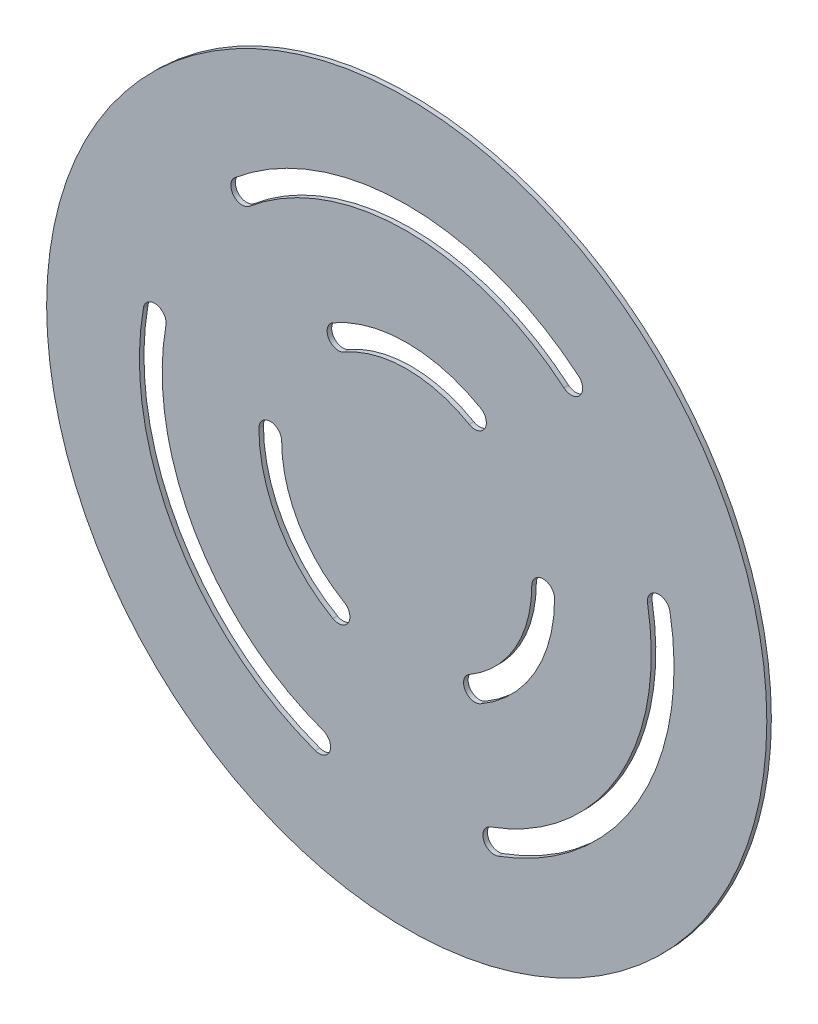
ISO-10303-21;
HEADER;
FILE_DESCRIPTION(('STEP AP214'),'2;1');
FILE_NAME('part.step','',(''),(''),'','','');
FILE_SCHEMA(('AUTOMOTIVE_DESIGN { 1 0 10303 214 1 1 1 1 }'));
ENDSEC;
DATA;
#1=APPLICATION_CONTEXT('core data for automotive mechanical design processes');
#2=APPLICATION_PROTOCOL_DEFINITION('international standard','automotive_design',2000,#1);
#3=PRODUCT_CONTEXT('',#1,'mechanical');
#4=PRODUCT('Part','Part','',(#3));
#5=PRODUCT_RELATED_PRODUCT_CATEGORY('part','',(#4));
#6=PRODUCT_DEFINITION_FORMATION('','',#4);
#7=PRODUCT_DEFINITION_CONTEXT('part definition',#1,'design');
#8=PRODUCT_DEFINITION('design','',#6,#7);
#9=PRODUCT_DEFINITION_SHAPE('','',#8);
#10=(LENGTH_UNIT() NAMED_UNIT(*) SI_UNIT(.MILLI.,.METRE.));
#11=(NAMED_UNIT(*) PLANE_ANGLE_UNIT() SI_UNIT($,.RADIAN.));
#12=(NAMED_UNIT(*) SI_UNIT($,.STERADIAN.) SOLID_ANGLE_UNIT());
#13=UNCERTAINTY_MEASURE_WITH_UNIT(LENGTH_MEASURE(1.E-05),#10,'distance_accuracy_value','');
#14=(GEOMETRIC_REPRESENTATION_CONTEXT(3) GLOBAL_UNCERTAINTY_ASSIGNED_CONTEXT((#13)) GLOBAL_UNIT_ASSIGNED_CONTEXT((#10,
#11,#12)) REPRESENTATION_CONTEXT('',''));
#15=CARTESIAN_POINT('',(0.,0.,0.));
#16=DIRECTION('',(0.,0.,1.));
#17=DIRECTION('',(1.,0.,0.));
#18=AXIS2_PLACEMENT_3D('',#15,#16,#17);
#19=CARTESIAN_POINT('',(0.,0.,2.));
#20=DIRECTION('',(0.,0.,-1.));
#21=DIRECTION('',(-1.,0.,0.));
#22=AXIS2_PLACEMENT_3D('',#19,#20,#21);
#23=CYLINDRICAL_SURFACE('',#22,158.);
#24=CARTESIAN_POINT('',(0.,0.,2.));
#25=DIRECTION('',(0.,0.,1.));
#26=DIRECTION('',(1.,0.,0.));
#27=AXIS2_PLACEMENT_3D('',#24,#25,#26);
#28=CIRCLE('',#27,158.);
#29=CARTESIAN_POINT('',(158.,0.,2.));
#30=VERTEX_POINT('',#29);
#31=EDGE_CURVE('E324',#30,#30,#28,.T.);
#32=ORIENTED_EDGE('',*,*,#31,.F.);
#33=EDGE_LOOP('',(#32));
#34=FACE_BOUND('',#33,.T.);
#35=CARTESIAN_POINT('',(0.,0.,0.));
#36=DIRECTION('',(0.,0.,1.));
#37=DIRECTION('',(1.,0.,0.));
#38=AXIS2_PLACEMENT_3D('',#35,#36,#37);
#39=CIRCLE('',#38,158.);
#40=CARTESIAN_POINT('',(158.,0.,0.));
#41=VERTEX_POINT('',#40);
#42=EDGE_CURVE('E317',#41,#41,#39,.T.);
#43=ORIENTED_EDGE('',*,*,#42,.T.);
#44=EDGE_LOOP('',(#43));
#45=FACE_BOUND('',#44,.T.);
#46=ADVANCED_FACE('F32',(#34,#45),#23,.T.);
#47=CARTESIAN_POINT('',(0.,0.,2.));
#48=DIRECTION('',(0.,0.,1.));
#49=DIRECTION('',(1.,0.,0.));
#50=AXIS2_PLACEMENT_3D('',#47,#48,#49);
#51=PLANE('',#50);
#52=CARTESIAN_POINT('',(-110.588321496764,19.4997048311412,2.));
#53=DIRECTION('',(0.,0.,1.));
#54=DIRECTION('',(-0.500000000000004,0.866025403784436,0.));
#55=AXIS2_PLACEMENT_3D('',#52,#53,#54);
#56=CIRCLE('',#55,5.00000000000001);
#57=CARTESIAN_POINT('',(-105.664282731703,18.6314639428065,2.));
#58=VERTEX_POINT('',#57);
#59=CARTESIAN_POINT('',(-115.512360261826,20.3679457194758,2.));
#60=VERTEX_POINT('',#59);
#61=EDGE_CURVE('E46',#58,#60,#56,.T.);
#62=ORIENTED_EDGE('',*,*,#61,.F.);
#63=CARTESIAN_POINT('',(2.04314785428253E-13,1.17961196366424E-13,2.));
#64=DIRECTION('',(0.,0.,-1.));
#65=DIRECTION('',(-0.500000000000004,0.866025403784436,0.));
#66=AXIS2_PLACEMENT_3D('',#63,#64,#65);
#67=CIRCLE('',#66,107.294324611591);
#68=CARTESIAN_POINT('',(-36.6968202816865,-100.82368508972,2.));
#69=VERTEX_POINT('',#68);
#70=EDGE_CURVE('E216',#69,#58,#67,.T.);
#71=ORIENTED_EDGE('',*,*,#70,.F.);
#72=CARTESIAN_POINT('',(-38.4069209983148,-105.52214819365,2.));
#73=DIRECTION('',(0.,0.,1.));
#74=DIRECTION('',(-0.500000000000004,0.866025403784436,0.));
#75=AXIS2_PLACEMENT_3D('',#72,#73,#74);
#76=CIRCLE('',#75,5.00000000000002);
#77=CARTESIAN_POINT('',(-40.1170217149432,-110.220611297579,2.));
#78=VERTEX_POINT('',#77);
#79=EDGE_CURVE('E199',#78,#69,#76,.T.);
#80=ORIENTED_EDGE('',*,*,#79,.F.);
#81=CARTESIAN_POINT('',(2.04314785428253E-13,1.17961196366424E-13,2.));
#82=DIRECTION('',(0.,0.,1.));
#83=DIRECTION('',(-0.500000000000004,0.866025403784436,0.));
#84=AXIS2_PLACEMENT_3D('',#81,#82,#83);
#85=CIRCLE('',#84,117.294324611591);
#86=EDGE_CURVE('E209',#60,#78,#85,.T.);
#87=ORIENTED_EDGE('',*,*,#86,.F.);
#88=EDGE_LOOP('',(#62,#71,#80,#87));
#89=FACE_BOUND('',#88,.T.);
#90=CARTESIAN_POINT('',(38.4069209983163,-105.522148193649,2.));
#91=DIRECTION('',(0.,0.,1.));
#92=DIRECTION('',(-0.499999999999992,-0.866025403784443,0.));
#93=AXIS2_PLACEMENT_3D('',#90,#91,#92);
#94=CIRCLE('',#93,5.00000000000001);
#95=CARTESIAN_POINT('',(36.696820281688,-100.82368508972,2.));
#96=VERTEX_POINT('',#95);
#97=CARTESIAN_POINT('',(40.1170217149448,-110.220611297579,2.));
#98=VERTEX_POINT('',#97);
#99=EDGE_CURVE('E54',#96,#98,#94,.T.);
#100=ORIENTED_EDGE('',*,*,#99,.F.);
#101=CARTESIAN_POINT('',(-2.04314785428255E-13,1.17961196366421E-13,2.));
#102=DIRECTION('',(0.,0.,-1.));
#103=DIRECTION('',(-0.499999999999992,-0.866025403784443,0.));
#104=AXIS2_PLACEMENT_3D('',#101,#102,#103);
#105=CIRCLE('',#104,107.294324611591);
#106=CARTESIAN_POINT('',(105.664282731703,18.631463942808,2.));
#107=VERTEX_POINT('',#106);
#108=EDGE_CURVE('E233',#107,#96,#105,.T.);
#109=ORIENTED_EDGE('',*,*,#108,.F.);
#110=CARTESIAN_POINT('',(110.588321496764,19.4997048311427,2.));
#111=DIRECTION('',(0.,0.,1.));
#112=DIRECTION('',(-0.499999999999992,-0.866025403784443,0.));
#113=AXIS2_PLACEMENT_3D('',#110,#111,#112);
#114=CIRCLE('',#113,5.00000000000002);
#115=CARTESIAN_POINT('',(115.512360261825,20.3679457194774,2.));
#116=VERTEX_POINT('',#115);
#117=EDGE_CURVE('E230',#116,#107,#114,.T.);
#118=ORIENTED_EDGE('',*,*,#117,.F.);
#119=CARTESIAN_POINT('',(-2.04314785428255E-13,1.17961196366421E-13,2.));
#120=DIRECTION('',(0.,0.,1.));
#121=DIRECTION('',(-0.499999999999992,-0.866025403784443,0.));
#122=AXIS2_PLACEMENT_3D('',#119,#120,#121);
#123=CIRCLE('',#122,117.294324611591);
#124=EDGE_CURVE('E227',#98,#116,#123,.T.);
#125=ORIENTED_EDGE('',*,*,#124,.F.);
#126=EDGE_LOOP('',(#100,#109,#118,#125));
#127=FACE_BOUND('',#126,.T.);
#128=CARTESIAN_POINT('',(29.9356442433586,-51.8500567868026,2.));
#129=DIRECTION('',(0.,0.,1.));
#130=DIRECTION('',(-0.499999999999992,-0.866025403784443,0.));
#131=AXIS2_PLACEMENT_3D('',#128,#129,#130);
#132=CIRCLE('',#131,5.);
#133=CARTESIAN_POINT('',(27.4356442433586,-47.5199297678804,2.));
#134=VERTEX_POINT('',#133);
#135=CARTESIAN_POINT('',(32.4356442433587,-56.1801838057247,2.));
#136=VERTEX_POINT('',#135);
#137=EDGE_CURVE('E239',#134,#136,#132,.T.);
#138=ORIENTED_EDGE('',*,*,#137,.F.);
#139=CARTESIAN_POINT('',(0.,0.,2.));
#140=DIRECTION('',(0.,0.,-1.));
#141=DIRECTION('',(-0.499999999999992,-0.866025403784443,0.));
#142=AXIS2_PLACEMENT_3D('',#139,#140,#141);
#143=CIRCLE('',#142,54.8712884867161);
#144=CARTESIAN_POINT('',(54.8712884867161,5.13478148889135E-13,2.));
#145=VERTEX_POINT('',#144);
#146=EDGE_CURVE('E252',#145,#134,#143,.T.);
#147=ORIENTED_EDGE('',*,*,#146,.F.);
#148=CARTESIAN_POINT('',(59.8712884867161,5.55111512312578E-13,2.));
#149=DIRECTION('',(0.,0.,1.));
#150=DIRECTION('',(-0.499999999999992,-0.866025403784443,0.));
#151=AXIS2_PLACEMENT_3D('',#148,#149,#150);
#152=CIRCLE('',#151,4.99999999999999);
#153=CARTESIAN_POINT('',(64.8712884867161,6.07153216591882E-13,2.));
#154=VERTEX_POINT('',#153);
#155=EDGE_CURVE('E249',#154,#145,#152,.T.);
#156=ORIENTED_EDGE('',*,*,#155,.F.);
#157=CARTESIAN_POINT('',(0.,0.,2.));
#158=DIRECTION('',(0.,0.,1.));
#159=DIRECTION('',(-0.499999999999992,-0.866025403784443,0.));
#160=AXIS2_PLACEMENT_3D('',#157,#158,#159);
#161=CIRCLE('',#160,64.8712884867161);
#162=EDGE_CURVE('E246',#136,#154,#161,.T.);
#163=ORIENTED_EDGE('',*,*,#162,.F.);
#164=EDGE_LOOP('',(#138,#147,#156,#163));
#165=FACE_BOUND('',#164,.T.);
#166=CARTESIAN_POINT('',(-59.8712884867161,-3.88578058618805E-13,2.));
#167=DIRECTION('',(0.,0.,1.));
#168=DIRECTION('',(-0.500000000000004,0.866025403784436,0.));
#169=AXIS2_PLACEMENT_3D('',#166,#167,#168);
#170=CIRCLE('',#169,5.);
#171=CARTESIAN_POINT('',(-54.8712884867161,-3.57353036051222E-13,2.));
#172=VERTEX_POINT('',#171);
#173=CARTESIAN_POINT('',(-64.8712884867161,-4.26741975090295E-13,2.));
#174=VERTEX_POINT('',#173);
#175=EDGE_CURVE('E223',#172,#174,#170,.T.);
#176=ORIENTED_EDGE('',*,*,#175,.F.);
#177=CARTESIAN_POINT('',(0.,0.,2.));
#178=DIRECTION('',(0.,0.,-1.));
#179=DIRECTION('',(-0.500000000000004,0.866025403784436,0.));
#180=AXIS2_PLACEMENT_3D('',#177,#178,#179);
#181=CIRCLE('',#180,54.8712884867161);
#182=CARTESIAN_POINT('',(-27.4356442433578,-47.5199297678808,2.));
#183=VERTEX_POINT('',#182);
#184=EDGE_CURVE('E271',#183,#172,#181,.T.);
#185=ORIENTED_EDGE('',*,*,#184,.F.);
#186=CARTESIAN_POINT('',(-29.9356442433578,-51.850056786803,2.));
#187=DIRECTION('',(0.,0.,1.));
#188=DIRECTION('',(-0.500000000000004,0.866025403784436,0.));
#189=AXIS2_PLACEMENT_3D('',#186,#187,#188);
#190=CIRCLE('',#189,4.99999999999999);
#191=CARTESIAN_POINT('',(-32.4356442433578,-56.1801838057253,2.));
#192=VERTEX_POINT('',#191);
#193=EDGE_CURVE('E268',#192,#183,#190,.T.);
#194=ORIENTED_EDGE('',*,*,#193,.F.);
#195=CARTESIAN_POINT('',(0.,0.,2.));
#196=DIRECTION('',(0.,0.,1.));
#197=DIRECTION('',(-0.500000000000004,0.866025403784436,0.));
#198=AXIS2_PLACEMENT_3D('',#195,#196,#197);
#199=CIRCLE('',#198,64.8712884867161);
#200=EDGE_CURVE('E265',#174,#192,#199,.T.);
#201=ORIENTED_EDGE('',*,*,#200,.F.);
#202=EDGE_LOOP('',(#176,#185,#194,#201));
#203=FACE_BOUND('',#202,.T.);
#204=CARTESIAN_POINT('',(72.181400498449,86.0224433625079,2.));
#205=DIRECTION('',(0.,0.,1.));
#206=DIRECTION('',(1.,0.,0.));
#207=AXIS2_PLACEMENT_3D('',#204,#205,#206);
#208=CIRCLE('',#207,5.00000000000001);
#209=CARTESIAN_POINT('',(68.9674624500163,82.192221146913,2.));
#210=VERTEX_POINT('',#209);
#211=CARTESIAN_POINT('',(75.3953385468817,89.8526655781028,2.));
#212=VERTEX_POINT('',#211);
#213=EDGE_CURVE('E277',#210,#212,#208,.T.);
#214=ORIENTED_EDGE('',*,*,#213,.F.);
#215=CARTESIAN_POINT('',(0.,-2.35922392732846E-13,2.));
#216=DIRECTION('',(0.,0.,-1.));
#217=DIRECTION('',(1.,0.,0.));
#218=AXIS2_PLACEMENT_3D('',#215,#216,#217);
#219=CIRCLE('',#218,107.294324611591);
#220=CARTESIAN_POINT('',(-68.9674624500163,82.1922211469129,2.));
#221=VERTEX_POINT('',#220);
#222=EDGE_CURVE('E291',#221,#210,#219,.T.);
#223=ORIENTED_EDGE('',*,*,#222,.F.);
#224=CARTESIAN_POINT('',(-72.1814004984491,86.0224433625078,2.));
#225=DIRECTION('',(0.,0.,1.));
#226=DIRECTION('',(1.,0.,0.));
#227=AXIS2_PLACEMENT_3D('',#224,#225,#226);
#228=CIRCLE('',#227,5.00000000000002);
#229=CARTESIAN_POINT('',(-75.3953385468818,89.8526655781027,2.));
#230=VERTEX_POINT('',#229);
#231=EDGE_CURVE('E288',#230,#221,#228,.T.);
#232=ORIENTED_EDGE('',*,*,#231,.F.);
#233=CARTESIAN_POINT('',(0.,-2.35922392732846E-13,2.));
#234=DIRECTION('',(0.,0.,1.));
#235=DIRECTION('',(1.,0.,0.));
#236=AXIS2_PLACEMENT_3D('',#233,#234,#235);
#237=CIRCLE('',#236,117.294324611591);
#238=EDGE_CURVE('E285',#212,#230,#237,.T.);
#239=ORIENTED_EDGE('',*,*,#238,.F.);
#240=EDGE_LOOP('',(#214,#223,#232,#239));
#241=FACE_BOUND('',#240,.T.);
#242=CARTESIAN_POINT('',(29.9356442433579,51.8500567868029,2.));
#243=DIRECTION('',(0.,0.,1.));
#244=DIRECTION('',(1.,0.,0.));
#245=AXIS2_PLACEMENT_3D('',#242,#243,#244);
#246=CIRCLE('',#245,5.);
#247=CARTESIAN_POINT('',(27.4356442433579,47.5199297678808,2.));
#248=VERTEX_POINT('',#247);
#249=CARTESIAN_POINT('',(32.4356442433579,56.1801838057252,2.));
#250=VERTEX_POINT('',#249);
#251=EDGE_CURVE('E297',#248,#250,#246,.T.);
#252=ORIENTED_EDGE('',*,*,#251,.F.);
#253=CARTESIAN_POINT('',(0.,0.,2.));
#254=DIRECTION('',(0.,0.,-1.));
#255=DIRECTION('',(1.,0.,0.));
#256=AXIS2_PLACEMENT_3D('',#253,#254,#255);
#257=CIRCLE('',#256,54.8712884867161);
#258=CARTESIAN_POINT('',(-27.435644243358,47.5199297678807,2.));
#259=VERTEX_POINT('',#258);
#260=EDGE_CURVE('E311',#259,#248,#257,.T.);
#261=ORIENTED_EDGE('',*,*,#260,.F.);
#262=CARTESIAN_POINT('',(-29.935644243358,51.8500567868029,2.));
#263=DIRECTION('',(0.,0.,1.));
#264=DIRECTION('',(1.,0.,0.));
#265=AXIS2_PLACEMENT_3D('',#262,#263,#264);
#266=CIRCLE('',#265,4.99999999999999);
#267=CARTESIAN_POINT('',(-32.435644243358,56.1801838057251,2.));
#268=VERTEX_POINT('',#267);
#269=EDGE_CURVE('E308',#268,#259,#266,.T.);
#270=ORIENTED_EDGE('',*,*,#269,.F.);
#271=CARTESIAN_POINT('',(0.,0.,2.));
#272=DIRECTION('',(0.,0.,1.));
#273=DIRECTION('',(1.,0.,0.));
#274=AXIS2_PLACEMENT_3D('',#271,#272,#273);
#275=CIRCLE('',#274,64.8712884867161);
#276=EDGE_CURVE('E305',#250,#268,#275,.T.);
#277=ORIENTED_EDGE('',*,*,#276,.F.);
#278=EDGE_LOOP('',(#252,#261,#270,#277));
#279=FACE_BOUND('',#278,.T.);
#280=ORIENTED_EDGE('',*,*,#31,.T.);
#281=EDGE_LOOP('',(#280));
#282=FACE_BOUND('',#281,.T.);
#283=ADVANCED_FACE('F213',(#89,#127,#165,#203,#241,#279,#282),#51,.T.);
#284=CARTESIAN_POINT('',(0.,0.,0.));
#285=DIRECTION('',(0.,0.,1.));
#286=DIRECTION('',(1.,0.,0.));
#287=AXIS2_PLACEMENT_3D('',#284,#285,#286);
#288=PLANE('',#287);
#289=CARTESIAN_POINT('',(2.04314785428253E-13,1.17961196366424E-13,0.));
#290=DIRECTION('',(0.,0.,1.));
#291=DIRECTION('',(1.,0.,0.));
#292=AXIS2_PLACEMENT_3D('',#289,#290,#291);
#293=CIRCLE('',#292,107.294324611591);
#294=CARTESIAN_POINT('',(-36.6968202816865,-100.82368508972,0.));
#295=VERTEX_POINT('',#294);
#296=CARTESIAN_POINT('',(-105.664282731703,18.6314639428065,0.));
#297=VERTEX_POINT('',#296);
#298=EDGE_CURVE('E39',#295,#297,#293,.F.);
#299=ORIENTED_EDGE('',*,*,#298,.T.);
#300=CARTESIAN_POINT('',(-110.588321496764,19.4997048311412,0.));
#301=DIRECTION('',(0.,0.,1.));
#302=DIRECTION('',(1.,0.,0.));
#303=AXIS2_PLACEMENT_3D('',#300,#301,#302);
#304=CIRCLE('',#303,5.00000000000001);
#305=CARTESIAN_POINT('',(-115.512360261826,20.3679457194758,0.));
#306=VERTEX_POINT('',#305);
#307=EDGE_CURVE('E11',#297,#306,#304,.T.);
#308=ORIENTED_EDGE('',*,*,#307,.T.);
#309=CARTESIAN_POINT('',(2.04314785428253E-13,1.17961196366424E-13,0.));
#310=DIRECTION('',(0.,0.,1.));
#311=DIRECTION('',(1.,0.,0.));
#312=AXIS2_PLACEMENT_3D('',#309,#310,#311);
#313=CIRCLE('',#312,117.294324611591);
#314=CARTESIAN_POINT('',(-40.1170217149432,-110.220611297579,0.));
#315=VERTEX_POINT('',#314);
#316=EDGE_CURVE('E389',#306,#315,#313,.T.);
#317=ORIENTED_EDGE('',*,*,#316,.T.);
#318=CARTESIAN_POINT('',(-38.4069209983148,-105.52214819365,0.));
#319=DIRECTION('',(0.,0.,1.));
#320=DIRECTION('',(1.,0.,0.));
#321=AXIS2_PLACEMENT_3D('',#318,#319,#320);
#322=CIRCLE('',#321,5.00000000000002);
#323=EDGE_CURVE('E202',#315,#295,#322,.T.);
#324=ORIENTED_EDGE('',*,*,#323,.T.);
#325=EDGE_LOOP('',(#299,#308,#317,#324));
#326=FACE_BOUND('',#325,.T.);
#327=CARTESIAN_POINT('',(-2.04314785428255E-13,1.17961196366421E-13,0.));
#328=DIRECTION('',(0.,0.,1.));
#329=DIRECTION('',(1.,0.,0.));
#330=AXIS2_PLACEMENT_3D('',#327,#328,#329);
#331=CIRCLE('',#330,107.294324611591);
#332=CARTESIAN_POINT('',(105.664282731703,18.631463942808,0.));
#333=VERTEX_POINT('',#332);
#334=CARTESIAN_POINT('',(36.696820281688,-100.82368508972,0.));
#335=VERTEX_POINT('',#334);
#336=EDGE_CURVE('E383',#333,#335,#331,.F.);
#337=ORIENTED_EDGE('',*,*,#336,.T.);
#338=CARTESIAN_POINT('',(38.4069209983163,-105.522148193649,0.));
#339=DIRECTION('',(0.,0.,1.));
#340=DIRECTION('',(1.,0.,0.));
#341=AXIS2_PLACEMENT_3D('',#338,#339,#340);
#342=CIRCLE('',#341,5.00000000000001);
#343=CARTESIAN_POINT('',(40.1170217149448,-110.220611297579,0.));
#344=VERTEX_POINT('',#343);
#345=EDGE_CURVE('E386',#335,#344,#342,.T.);
#346=ORIENTED_EDGE('',*,*,#345,.T.);
#347=CARTESIAN_POINT('',(-2.04314785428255E-13,1.17961196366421E-13,0.));
#348=DIRECTION('',(0.,0.,1.));
#349=DIRECTION('',(1.,0.,0.));
#350=AXIS2_PLACEMENT_3D('',#347,#348,#349);
#351=CIRCLE('',#350,117.294324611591);
#352=CARTESIAN_POINT('',(115.512360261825,20.3679457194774,0.));
#353=VERTEX_POINT('',#352);
#354=EDGE_CURVE('E377',#344,#353,#351,.T.);
#355=ORIENTED_EDGE('',*,*,#354,.T.);
#356=CARTESIAN_POINT('',(110.588321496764,19.4997048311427,0.));
#357=DIRECTION('',(0.,0.,1.));
#358=DIRECTION('',(1.,0.,0.));
#359=AXIS2_PLACEMENT_3D('',#356,#357,#358);
#360=CIRCLE('',#359,5.00000000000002);
#361=EDGE_CURVE('E380',#353,#333,#360,.T.);
#362=ORIENTED_EDGE('',*,*,#361,.T.);
#363=EDGE_LOOP('',(#337,#346,#355,#362));
#364=FACE_BOUND('',#363,.T.);
#365=CARTESIAN_POINT('',(0.,0.,0.));
#366=DIRECTION('',(0.,0.,1.));
#367=DIRECTION('',(1.,0.,0.));
#368=AXIS2_PLACEMENT_3D('',#365,#366,#367);
#369=CIRCLE('',#368,54.8712884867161);
#370=CARTESIAN_POINT('',(54.8712884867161,5.13478148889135E-13,0.));
#371=VERTEX_POINT('',#370);
#372=CARTESIAN_POINT('',(27.4356442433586,-47.5199297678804,0.));
#373=VERTEX_POINT('',#372);
#374=EDGE_CURVE('E371',#371,#373,#369,.F.);
#375=ORIENTED_EDGE('',*,*,#374,.T.);
#376=CARTESIAN_POINT('',(29.9356442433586,-51.8500567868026,0.));
#377=DIRECTION('',(0.,0.,1.));
#378=DIRECTION('',(1.,0.,0.));
#379=AXIS2_PLACEMENT_3D('',#376,#377,#378);
#380=CIRCLE('',#379,5.);
#381=CARTESIAN_POINT('',(32.4356442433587,-56.1801838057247,0.));
#382=VERTEX_POINT('',#381);
#383=EDGE_CURVE('E374',#373,#382,#380,.T.);
#384=ORIENTED_EDGE('',*,*,#383,.T.);
#385=CARTESIAN_POINT('',(0.,0.,0.));
#386=DIRECTION('',(0.,0.,1.));
#387=DIRECTION('',(1.,0.,0.));
#388=AXIS2_PLACEMENT_3D('',#385,#386,#387);
#389=CIRCLE('',#388,64.8712884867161);
#390=CARTESIAN_POINT('',(64.8712884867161,0.,0.));
#391=VERTEX_POINT('',#390);
#392=EDGE_CURVE('E365',#382,#391,#389,.T.);
#393=ORIENTED_EDGE('',*,*,#392,.T.);
#394=CARTESIAN_POINT('',(59.8712884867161,5.55111512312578E-13,0.));
#395=DIRECTION('',(0.,0.,1.));
#396=DIRECTION('',(1.,0.,0.));
#397=AXIS2_PLACEMENT_3D('',#394,#395,#396);
#398=CIRCLE('',#397,4.99999999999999);
#399=EDGE_CURVE('E368',#391,#371,#398,.T.);
#400=ORIENTED_EDGE('',*,*,#399,.T.);
#401=EDGE_LOOP('',(#375,#384,#393,#400));
#402=FACE_BOUND('',#401,.T.);
#403=CARTESIAN_POINT('',(0.,0.,0.));
#404=DIRECTION('',(0.,0.,1.));
#405=DIRECTION('',(1.,0.,0.));
#406=AXIS2_PLACEMENT_3D('',#403,#404,#405);
#407=CIRCLE('',#406,54.8712884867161);
#408=CARTESIAN_POINT('',(-27.4356442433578,-47.5199297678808,0.));
#409=VERTEX_POINT('',#408);
#410=CARTESIAN_POINT('',(-54.8712884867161,-3.57353036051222E-13,0.));
#411=VERTEX_POINT('',#410);
#412=EDGE_CURVE('E359',#409,#411,#407,.F.);
#413=ORIENTED_EDGE('',*,*,#412,.T.);
#414=CARTESIAN_POINT('',(-59.8712884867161,-3.88578058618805E-13,0.));
#415=DIRECTION('',(0.,0.,1.));
#416=DIRECTION('',(1.,0.,0.));
#417=AXIS2_PLACEMENT_3D('',#414,#415,#416);
#418=CIRCLE('',#417,5.);
#419=CARTESIAN_POINT('',(-64.8712884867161,-4.26741975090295E-13,0.));
#420=VERTEX_POINT('',#419);
#421=EDGE_CURVE('E362',#411,#420,#418,.T.);
#422=ORIENTED_EDGE('',*,*,#421,.T.);
#423=CARTESIAN_POINT('',(0.,0.,0.));
#424=DIRECTION('',(0.,0.,1.));
#425=DIRECTION('',(1.,0.,0.));
#426=AXIS2_PLACEMENT_3D('',#423,#424,#425);
#427=CIRCLE('',#426,64.8712884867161);
#428=CARTESIAN_POINT('',(-32.4356442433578,-56.1801838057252,0.));
#429=VERTEX_POINT('',#428);
#430=EDGE_CURVE('E353',#420,#429,#427,.T.);
#431=ORIENTED_EDGE('',*,*,#430,.T.);
#432=CARTESIAN_POINT('',(-29.9356442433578,-51.850056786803,0.));
#433=DIRECTION('',(0.,0.,1.));
#434=DIRECTION('',(1.,0.,0.));
#435=AXIS2_PLACEMENT_3D('',#432,#433,#434);
#436=CIRCLE('',#435,4.99999999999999);
#437=EDGE_CURVE('E356',#429,#409,#436,.T.);
#438=ORIENTED_EDGE('',*,*,#437,.T.);
#439=EDGE_LOOP('',(#413,#422,#431,#438));
#440=FACE_BOUND('',#439,.T.);
#441=CARTESIAN_POINT('',(0.,-2.35922392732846E-13,0.));
#442=DIRECTION('',(0.,0.,1.));
#443=DIRECTION('',(1.,0.,0.));
#444=AXIS2_PLACEMENT_3D('',#441,#442,#443);
#445=CIRCLE('',#444,107.294324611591);
#446=CARTESIAN_POINT('',(-68.9674624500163,82.1922211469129,0.));
#447=VERTEX_POINT('',#446);
#448=CARTESIAN_POINT('',(68.9674624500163,82.192221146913,0.));
#449=VERTEX_POINT('',#448);
#450=EDGE_CURVE('E347',#447,#449,#445,.F.);
#451=ORIENTED_EDGE('',*,*,#450,.T.);
#452=CARTESIAN_POINT('',(72.181400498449,86.0224433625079,0.));
#453=DIRECTION('',(0.,0.,1.));
#454=DIRECTION('',(1.,0.,0.));
#455=AXIS2_PLACEMENT_3D('',#452,#453,#454);
#456=CIRCLE('',#455,5.00000000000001);
#457=CARTESIAN_POINT('',(75.3953385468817,89.8526655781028,0.));
#458=VERTEX_POINT('',#457);
#459=EDGE_CURVE('E350',#449,#458,#456,.T.);
#460=ORIENTED_EDGE('',*,*,#459,.T.);
#461=CARTESIAN_POINT('',(0.,-2.35922392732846E-13,0.));
#462=DIRECTION('',(0.,0.,1.));
#463=DIRECTION('',(1.,0.,0.));
#464=AXIS2_PLACEMENT_3D('',#461,#462,#463);
#465=CIRCLE('',#464,117.294324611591);
#466=CARTESIAN_POINT('',(-75.3953385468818,89.8526655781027,0.));
#467=VERTEX_POINT('',#466);
#468=EDGE_CURVE('E341',#458,#467,#465,.T.);
#469=ORIENTED_EDGE('',*,*,#468,.T.);
#470=CARTESIAN_POINT('',(-72.1814004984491,86.0224433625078,0.));
#471=DIRECTION('',(0.,0.,1.));
#472=DIRECTION('',(1.,0.,0.));
#473=AXIS2_PLACEMENT_3D('',#470,#471,#472);
#474=CIRCLE('',#473,5.00000000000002);
#475=EDGE_CURVE('E344',#467,#447,#474,.T.);
#476=ORIENTED_EDGE('',*,*,#475,.T.);
#477=EDGE_LOOP('',(#451,#460,#469,#476));
#478=FACE_BOUND('',#477,.T.);
#479=CARTESIAN_POINT('',(0.,0.,0.));
#480=DIRECTION('',(0.,0.,1.));
#481=DIRECTION('',(1.,0.,0.));
#482=AXIS2_PLACEMENT_3D('',#479,#480,#481);
#483=CIRCLE('',#482,54.8712884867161);
#484=CARTESIAN_POINT('',(-27.435644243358,47.5199297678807,0.));
#485=VERTEX_POINT('',#484);
#486=CARTESIAN_POINT('',(27.4356442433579,47.5199297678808,0.));
#487=VERTEX_POINT('',#486);
#488=EDGE_CURVE('E335',#485,#487,#483,.F.);
#489=ORIENTED_EDGE('',*,*,#488,.T.);
#490=CARTESIAN_POINT('',(29.9356442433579,51.8500567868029,0.));
#491=DIRECTION('',(0.,0.,1.));
#492=DIRECTION('',(1.,0.,0.));
#493=AXIS2_PLACEMENT_3D('',#490,#491,#492);
#494=CIRCLE('',#493,5.);
#495=CARTESIAN_POINT('',(32.4356442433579,56.1801838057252,0.));
#496=VERTEX_POINT('',#495);
#497=EDGE_CURVE('E338',#487,#496,#494,.T.);
#498=ORIENTED_EDGE('',*,*,#497,.T.);
#499=CARTESIAN_POINT('',(0.,0.,0.));
#500=DIRECTION('',(0.,0.,1.));
#501=DIRECTION('',(1.,0.,0.));
#502=AXIS2_PLACEMENT_3D('',#499,#500,#501);
#503=CIRCLE('',#502,64.8712884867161);
#504=CARTESIAN_POINT('',(-32.435644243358,56.1801838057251,0.));
#505=VERTEX_POINT('',#504);
#506=EDGE_CURVE('E327',#496,#505,#503,.T.);
#507=ORIENTED_EDGE('',*,*,#506,.T.);
#508=CARTESIAN_POINT('',(-29.935644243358,51.8500567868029,0.));
#509=DIRECTION('',(0.,0.,1.));
#510=DIRECTION('',(1.,0.,0.));
#511=AXIS2_PLACEMENT_3D('',#508,#509,#510);
#512=CIRCLE('',#511,4.99999999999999);
#513=EDGE_CURVE('E332',#505,#485,#512,.T.);
#514=ORIENTED_EDGE('',*,*,#513,.T.);
#515=EDGE_LOOP('',(#489,#498,#507,#514));
#516=FACE_BOUND('',#515,.T.);
#517=ORIENTED_EDGE('',*,*,#42,.F.);
#518=EDGE_LOOP('',(#517));
#519=FACE_BOUND('',#518,.T.);
#520=ADVANCED_FACE('F393',(#326,#364,#402,#440,#478,#516,#519),#288,.F.);
#521=CARTESIAN_POINT('',(29.9356442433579,51.8500567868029,-8.));
#522=DIRECTION('',(0.,0.,1.));
#523=DIRECTION('',(1.,0.,0.));
#524=AXIS2_PLACEMENT_3D('',#521,#522,#523);
#525=CYLINDRICAL_SURFACE('',#524,5.);
#526=DIRECTION('',(0.,0.,1.));
#527=VECTOR('',#526,1.);
#528=CARTESIAN_POINT('',(27.4356442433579,47.5199297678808,-8.));
#529=LINE('',#528,#527);
#530=EDGE_CURVE('E315',#487,#248,#529,.T.);
#531=ORIENTED_EDGE('',*,*,#530,.T.);
#532=ORIENTED_EDGE('',*,*,#251,.T.);
#533=DIRECTION('',(0.,0.,1.));
#534=VECTOR('',#533,1.);
#535=CARTESIAN_POINT('',(32.4356442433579,56.1801838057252,-8.));
#536=LINE('',#535,#534);
#537=EDGE_CURVE('E314',#496,#250,#536,.T.);
#538=ORIENTED_EDGE('',*,*,#537,.F.);
#539=ORIENTED_EDGE('',*,*,#497,.F.);
#540=EDGE_LOOP('',(#531,#532,#538,#539));
#541=FACE_BOUND('',#540,.T.);
#542=ADVANCED_FACE('F423',(#541),#525,.F.);
#543=CARTESIAN_POINT('',(0.,0.,-8.));
#544=DIRECTION('',(0.,0.,1.));
#545=DIRECTION('',(1.,0.,0.));
#546=AXIS2_PLACEMENT_3D('',#543,#544,#545);
#547=CYLINDRICAL_SURFACE('',#546,54.8712884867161);
#548=DIRECTION('',(0.,0.,1.));
#549=VECTOR('',#548,1.);
#550=CARTESIAN_POINT('',(-27.435644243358,47.5199297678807,-8.));
#551=LINE('',#550,#549);
#552=EDGE_CURVE('E318',#485,#259,#551,.T.);
#553=ORIENTED_EDGE('',*,*,#552,.T.);
#554=ORIENTED_EDGE('',*,*,#260,.T.);
#555=ORIENTED_EDGE('',*,*,#530,.F.);
#556=ORIENTED_EDGE('',*,*,#488,.F.);
#557=EDGE_LOOP('',(#553,#554,#555,#556));
#558=FACE_BOUND('',#557,.T.);
#559=ADVANCED_FACE('F427',(#558),#547,.T.);
#560=CARTESIAN_POINT('',(-29.935644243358,51.8500567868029,-8.));
#561=DIRECTION('',(0.,0.,1.));
#562=DIRECTION('',(1.,0.,0.));
#563=AXIS2_PLACEMENT_3D('',#560,#561,#562);
#564=CYLINDRICAL_SURFACE('',#563,4.99999999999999);
#565=DIRECTION('',(0.,0.,1.));
#566=VECTOR('',#565,1.);
#567=CARTESIAN_POINT('',(-32.435644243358,56.1801838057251,-8.));
#568=LINE('',#567,#566);
#569=EDGE_CURVE('E320',#505,#268,#568,.T.);
#570=ORIENTED_EDGE('',*,*,#569,.T.);
#571=ORIENTED_EDGE('',*,*,#269,.T.);
#572=ORIENTED_EDGE('',*,*,#552,.F.);
#573=ORIENTED_EDGE('',*,*,#513,.F.);
#574=EDGE_LOOP('',(#570,#571,#572,#573));
#575=FACE_BOUND('',#574,.T.);
#576=ADVANCED_FACE('F435',(#575),#564,.F.);
#577=CARTESIAN_POINT('',(0.,0.,-8.));
#578=DIRECTION('',(0.,0.,1.));
#579=DIRECTION('',(1.,0.,0.));
#580=AXIS2_PLACEMENT_3D('',#577,#578,#579);
#581=CYLINDRICAL_SURFACE('',#580,64.8712884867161);
#582=ORIENTED_EDGE('',*,*,#537,.T.);
#583=ORIENTED_EDGE('',*,*,#276,.T.);
#584=ORIENTED_EDGE('',*,*,#569,.F.);
#585=ORIENTED_EDGE('',*,*,#506,.F.);
#586=EDGE_LOOP('',(#582,#583,#584,#585));
#587=FACE_BOUND('',#586,.T.);
#588=ADVANCED_FACE('F431',(#587),#581,.F.);
#589=CARTESIAN_POINT('',(72.181400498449,86.0224433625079,-8.));
#590=DIRECTION('',(0.,0.,1.));
#591=DIRECTION('',(1.,0.,0.));
#592=AXIS2_PLACEMENT_3D('',#589,#590,#591);
#593=CYLINDRICAL_SURFACE('',#592,5.00000000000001);
#594=DIRECTION('',(0.,0.,1.));
#595=VECTOR('',#594,1.);
#596=CARTESIAN_POINT('',(68.9674624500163,82.192221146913,-8.));
#597=LINE('',#596,#595);
#598=EDGE_CURVE('E295',#449,#210,#597,.T.);
#599=ORIENTED_EDGE('',*,*,#598,.T.);
#600=ORIENTED_EDGE('',*,*,#213,.T.);
#601=DIRECTION('',(0.,0.,1.));
#602=VECTOR('',#601,1.);
#603=CARTESIAN_POINT('',(75.3953385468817,89.8526655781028,-8.));
#604=LINE('',#603,#602);
#605=EDGE_CURVE('E294',#458,#212,#604,.T.);
#606=ORIENTED_EDGE('',*,*,#605,.F.);
#607=ORIENTED_EDGE('',*,*,#459,.F.);
#608=EDGE_LOOP('',(#599,#600,#606,#607));
#609=FACE_BOUND('',#608,.T.);
#610=ADVANCED_FACE('F434',(#609),#593,.F.);
#611=CARTESIAN_POINT('',(0.,-2.35922392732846E-13,-8.));
#612=DIRECTION('',(0.,0.,1.));
#613=DIRECTION('',(1.,0.,0.));
#614=AXIS2_PLACEMENT_3D('',#611,#612,#613);
#615=CYLINDRICAL_SURFACE('',#614,107.294324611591);
#616=DIRECTION('',(0.,0.,1.));
#617=VECTOR('',#616,1.);
#618=CARTESIAN_POINT('',(-68.9674624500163,82.1922211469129,-8.));
#619=LINE('',#618,#617);
#620=EDGE_CURVE('E298',#447,#221,#619,.T.);
#621=ORIENTED_EDGE('',*,*,#620,.T.);
#622=ORIENTED_EDGE('',*,*,#222,.T.);
#623=ORIENTED_EDGE('',*,*,#598,.F.);
#624=ORIENTED_EDGE('',*,*,#450,.F.);
#625=EDGE_LOOP('',(#621,#622,#623,#624));
#626=FACE_BOUND('',#625,.T.);
#627=ADVANCED_FACE('F445',(#626),#615,.T.);
#628=CARTESIAN_POINT('',(-72.1814004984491,86.0224433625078,-8.));
#629=DIRECTION('',(0.,0.,1.));
#630=DIRECTION('',(1.,0.,0.));
#631=AXIS2_PLACEMENT_3D('',#628,#629,#630);
#632=CYLINDRICAL_SURFACE('',#631,5.00000000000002);
#633=DIRECTION('',(0.,0.,1.));
#634=VECTOR('',#633,1.);
#635=CARTESIAN_POINT('',(-75.3953385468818,89.8526655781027,-8.));
#636=LINE('',#635,#634);
#637=EDGE_CURVE('E300',#467,#230,#636,.T.);
#638=ORIENTED_EDGE('',*,*,#637,.T.);
#639=ORIENTED_EDGE('',*,*,#231,.T.);
#640=ORIENTED_EDGE('',*,*,#620,.F.);
#641=ORIENTED_EDGE('',*,*,#475,.F.);
#642=EDGE_LOOP('',(#638,#639,#640,#641));
#643=FACE_BOUND('',#642,.T.);
#644=ADVANCED_FACE('F451',(#643),#632,.F.);
#645=CARTESIAN_POINT('',(0.,-2.35922392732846E-13,-8.));
#646=DIRECTION('',(0.,0.,1.));
#647=DIRECTION('',(1.,0.,0.));
#648=AXIS2_PLACEMENT_3D('',#645,#646,#647);
#649=CYLINDRICAL_SURFACE('',#648,117.294324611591);
#650=ORIENTED_EDGE('',*,*,#605,.T.);
#651=ORIENTED_EDGE('',*,*,#238,.T.);
#652=ORIENTED_EDGE('',*,*,#637,.F.);
#653=ORIENTED_EDGE('',*,*,#468,.F.);
#654=EDGE_LOOP('',(#650,#651,#652,#653));
#655=FACE_BOUND('',#654,.T.);
#656=ADVANCED_FACE('F447',(#655),#649,.F.);
#657=CARTESIAN_POINT('',(-59.8712884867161,-3.88578058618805E-13,-8.));
#658=DIRECTION('',(0.,0.,1.));
#659=DIRECTION('',(1.,0.,0.));
#660=AXIS2_PLACEMENT_3D('',#657,#658,#659);
#661=CYLINDRICAL_SURFACE('',#660,5.);
#662=DIRECTION('',(0.,0.,1.));
#663=VECTOR('',#662,1.);
#664=CARTESIAN_POINT('',(-54.8712884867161,-3.57353036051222E-13,-8.));
#665=LINE('',#664,#663);
#666=EDGE_CURVE('E275',#411,#172,#665,.T.);
#667=ORIENTED_EDGE('',*,*,#666,.T.);
#668=ORIENTED_EDGE('',*,*,#175,.T.);
#669=DIRECTION('',(0.,0.,1.));
#670=VECTOR('',#669,1.);
#671=CARTESIAN_POINT('',(-64.8712884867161,-4.26741975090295E-13,-8.));
#672=LINE('',#671,#670);
#673=EDGE_CURVE('E274',#420,#174,#672,.T.);
#674=ORIENTED_EDGE('',*,*,#673,.F.);
#675=ORIENTED_EDGE('',*,*,#421,.F.);
#676=EDGE_LOOP('',(#667,#668,#674,#675));
#677=FACE_BOUND('',#676,.T.);
#678=ADVANCED_FACE('F450',(#677),#661,.F.);
#679=CARTESIAN_POINT('',(0.,0.,-8.));
#680=DIRECTION('',(0.,0.,1.));
#681=DIRECTION('',(1.,0.,0.));
#682=AXIS2_PLACEMENT_3D('',#679,#680,#681);
#683=CYLINDRICAL_SURFACE('',#682,54.8712884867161);
#684=DIRECTION('',(0.,0.,1.));
#685=VECTOR('',#684,1.);
#686=CARTESIAN_POINT('',(-27.4356442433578,-47.5199297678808,-8.));
#687=LINE('',#686,#685);
#688=EDGE_CURVE('E278',#409,#183,#687,.T.);
#689=ORIENTED_EDGE('',*,*,#688,.T.);
#690=ORIENTED_EDGE('',*,*,#184,.T.);
#691=ORIENTED_EDGE('',*,*,#666,.F.);
#692=ORIENTED_EDGE('',*,*,#412,.F.);
#693=EDGE_LOOP('',(#689,#690,#691,#692));
#694=FACE_BOUND('',#693,.T.);
#695=ADVANCED_FACE('F461',(#694),#683,.T.);
#696=CARTESIAN_POINT('',(-29.9356442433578,-51.850056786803,-8.));
#697=DIRECTION('',(0.,0.,1.));
#698=DIRECTION('',(1.,0.,0.));
#699=AXIS2_PLACEMENT_3D('',#696,#697,#698);
#700=CYLINDRICAL_SURFACE('',#699,4.99999999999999);
#701=DIRECTION('',(0.,0.,1.));
#702=VECTOR('',#701,1.);
#703=CARTESIAN_POINT('',(-32.4356442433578,-56.1801838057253,-8.));
#704=LINE('',#703,#702);
#705=EDGE_CURVE('E280',#429,#192,#704,.T.);
#706=ORIENTED_EDGE('',*,*,#705,.T.);
#707=ORIENTED_EDGE('',*,*,#193,.T.);
#708=ORIENTED_EDGE('',*,*,#688,.F.);
#709=ORIENTED_EDGE('',*,*,#437,.F.);
#710=EDGE_LOOP('',(#706,#707,#708,#709));
#711=FACE_BOUND('',#710,.T.);
#712=ADVANCED_FACE('F467',(#711),#700,.F.);
#713=CARTESIAN_POINT('',(0.,0.,-8.));
#714=DIRECTION('',(0.,0.,1.));
#715=DIRECTION('',(1.,0.,0.));
#716=AXIS2_PLACEMENT_3D('',#713,#714,#715);
#717=CYLINDRICAL_SURFACE('',#716,64.8712884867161);
#718=ORIENTED_EDGE('',*,*,#673,.T.);
#719=ORIENTED_EDGE('',*,*,#200,.T.);
#720=ORIENTED_EDGE('',*,*,#705,.F.);
#721=ORIENTED_EDGE('',*,*,#430,.F.);
#722=EDGE_LOOP('',(#718,#719,#720,#721));
#723=FACE_BOUND('',#722,.T.);
#724=ADVANCED_FACE('F463',(#723),#717,.F.);
#725=CARTESIAN_POINT('',(29.9356442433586,-51.8500567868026,-8.));
#726=DIRECTION('',(0.,0.,1.));
#727=DIRECTION('',(1.,0.,0.));
#728=AXIS2_PLACEMENT_3D('',#725,#726,#727);
#729=CYLINDRICAL_SURFACE('',#728,5.);
#730=DIRECTION('',(0.,0.,1.));
#731=VECTOR('',#730,1.);
#732=CARTESIAN_POINT('',(27.4356442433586,-47.5199297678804,-8.));
#733=LINE('',#732,#731);
#734=EDGE_CURVE('E256',#373,#134,#733,.T.);
#735=ORIENTED_EDGE('',*,*,#734,.T.);
#736=ORIENTED_EDGE('',*,*,#137,.T.);
#737=DIRECTION('',(0.,0.,1.));
#738=VECTOR('',#737,1.);
#739=CARTESIAN_POINT('',(32.4356442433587,-56.1801838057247,-8.));
#740=LINE('',#739,#738);
#741=EDGE_CURVE('E255',#382,#136,#740,.T.);
#742=ORIENTED_EDGE('',*,*,#741,.F.);
#743=ORIENTED_EDGE('',*,*,#383,.F.);
#744=EDGE_LOOP('',(#735,#736,#742,#743));
#745=FACE_BOUND('',#744,.T.);
#746=ADVANCED_FACE('F466',(#745),#729,.F.);
#747=CARTESIAN_POINT('',(0.,0.,-8.));
#748=DIRECTION('',(0.,0.,1.));
#749=DIRECTION('',(1.,0.,0.));
#750=AXIS2_PLACEMENT_3D('',#747,#748,#749);
#751=CYLINDRICAL_SURFACE('',#750,54.8712884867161);
#752=DIRECTION('',(0.,0.,1.));
#753=VECTOR('',#752,1.);
#754=CARTESIAN_POINT('',(54.8712884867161,5.13478148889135E-13,-8.));
#755=LINE('',#754,#753);
#756=EDGE_CURVE('E258',#371,#145,#755,.T.);
#757=ORIENTED_EDGE('',*,*,#756,.T.);
#758=ORIENTED_EDGE('',*,*,#146,.T.);
#759=ORIENTED_EDGE('',*,*,#734,.F.);
#760=ORIENTED_EDGE('',*,*,#374,.F.);
#761=EDGE_LOOP('',(#757,#758,#759,#760));
#762=FACE_BOUND('',#761,.T.);
#763=ADVANCED_FACE('F477',(#762),#751,.T.);
#764=CARTESIAN_POINT('',(59.8712884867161,5.55111512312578E-13,-8.));
#765=DIRECTION('',(0.,0.,1.));
#766=DIRECTION('',(1.,0.,0.));
#767=AXIS2_PLACEMENT_3D('',#764,#765,#766);
#768=CYLINDRICAL_SURFACE('',#767,4.99999999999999);
#769=DIRECTION('',(0.,0.,1.));
#770=VECTOR('',#769,1.);
#771=CARTESIAN_POINT('',(64.8712884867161,6.07153216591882E-13,-8.));
#772=LINE('',#771,#770);
#773=EDGE_CURVE('E260',#391,#154,#772,.T.);
#774=ORIENTED_EDGE('',*,*,#773,.T.);
#775=ORIENTED_EDGE('',*,*,#155,.T.);
#776=ORIENTED_EDGE('',*,*,#756,.F.);
#777=ORIENTED_EDGE('',*,*,#399,.F.);
#778=EDGE_LOOP('',(#774,#775,#776,#777));
#779=FACE_BOUND('',#778,.T.);
#780=ADVANCED_FACE('F483',(#779),#768,.F.);
#781=CARTESIAN_POINT('',(0.,0.,-8.));
#782=DIRECTION('',(0.,0.,1.));
#783=DIRECTION('',(1.,0.,0.));
#784=AXIS2_PLACEMENT_3D('',#781,#782,#783);
#785=CYLINDRICAL_SURFACE('',#784,64.8712884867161);
#786=ORIENTED_EDGE('',*,*,#741,.T.);
#787=ORIENTED_EDGE('',*,*,#162,.T.);
#788=ORIENTED_EDGE('',*,*,#773,.F.);
#789=ORIENTED_EDGE('',*,*,#392,.F.);
#790=EDGE_LOOP('',(#786,#787,#788,#789));
#791=FACE_BOUND('',#790,.T.);
#792=ADVANCED_FACE('F479',(#791),#785,.F.);
#793=CARTESIAN_POINT('',(38.4069209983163,-105.522148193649,-8.));
#794=DIRECTION('',(0.,0.,1.));
#795=DIRECTION('',(1.,0.,0.));
#796=AXIS2_PLACEMENT_3D('',#793,#794,#795);
#797=CYLINDRICAL_SURFACE('',#796,5.00000000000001);
#798=DIRECTION('',(0.,0.,1.));
#799=VECTOR('',#798,1.);
#800=CARTESIAN_POINT('',(36.696820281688,-100.82368508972,-8.));
#801=LINE('',#800,#799);
#802=EDGE_CURVE('E237',#335,#96,#801,.T.);
#803=ORIENTED_EDGE('',*,*,#802,.T.);
#804=ORIENTED_EDGE('',*,*,#99,.T.);
#805=DIRECTION('',(0.,0.,1.));
#806=VECTOR('',#805,1.);
#807=CARTESIAN_POINT('',(40.1170217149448,-110.220611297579,-8.));
#808=LINE('',#807,#806);
#809=EDGE_CURVE('E236',#344,#98,#808,.T.);
#810=ORIENTED_EDGE('',*,*,#809,.F.);
#811=ORIENTED_EDGE('',*,*,#345,.F.);
#812=EDGE_LOOP('',(#803,#804,#810,#811));
#813=FACE_BOUND('',#812,.T.);
#814=ADVANCED_FACE('F482',(#813),#797,.F.);
#815=CARTESIAN_POINT('',(-2.04314785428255E-13,1.17961196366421E-13,-8.));
#816=DIRECTION('',(0.,0.,1.));
#817=DIRECTION('',(1.,0.,0.));
#818=AXIS2_PLACEMENT_3D('',#815,#816,#817);
#819=CYLINDRICAL_SURFACE('',#818,107.294324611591);
#820=DIRECTION('',(0.,0.,1.));
#821=VECTOR('',#820,1.);
#822=CARTESIAN_POINT('',(105.664282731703,18.631463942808,-8.));
#823=LINE('',#822,#821);
#824=EDGE_CURVE('E240',#333,#107,#823,.T.);
#825=ORIENTED_EDGE('',*,*,#824,.T.);
#826=ORIENTED_EDGE('',*,*,#108,.T.);
#827=ORIENTED_EDGE('',*,*,#802,.F.);
#828=ORIENTED_EDGE('',*,*,#336,.F.);
#829=EDGE_LOOP('',(#825,#826,#827,#828));
#830=FACE_BOUND('',#829,.T.);
#831=ADVANCED_FACE('F492',(#830),#819,.T.);
#832=CARTESIAN_POINT('',(110.588321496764,19.4997048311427,-8.));
#833=DIRECTION('',(0.,0.,1.));
#834=DIRECTION('',(1.,0.,0.));
#835=AXIS2_PLACEMENT_3D('',#832,#833,#834);
#836=CYLINDRICAL_SURFACE('',#835,5.00000000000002);
#837=DIRECTION('',(0.,0.,1.));
#838=VECTOR('',#837,1.);
#839=CARTESIAN_POINT('',(115.512360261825,20.3679457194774,-8.));
#840=LINE('',#839,#838);
#841=EDGE_CURVE('E242',#353,#116,#840,.T.);
#842=ORIENTED_EDGE('',*,*,#841,.T.);
#843=ORIENTED_EDGE('',*,*,#117,.T.);
#844=ORIENTED_EDGE('',*,*,#824,.F.);
#845=ORIENTED_EDGE('',*,*,#361,.F.);
#846=EDGE_LOOP('',(#842,#843,#844,#845));
#847=FACE_BOUND('',#846,.T.);
#848=ADVANCED_FACE('F407',(#847),#836,.F.);
#849=CARTESIAN_POINT('',(-2.04314785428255E-13,1.17961196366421E-13,-8.));
#850=DIRECTION('',(0.,0.,1.));
#851=DIRECTION('',(1.,0.,0.));
#852=AXIS2_PLACEMENT_3D('',#849,#850,#851);
#853=CYLINDRICAL_SURFACE('',#852,117.294324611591);
#854=ORIENTED_EDGE('',*,*,#809,.T.);
#855=ORIENTED_EDGE('',*,*,#124,.T.);
#856=ORIENTED_EDGE('',*,*,#841,.F.);
#857=ORIENTED_EDGE('',*,*,#354,.F.);
#858=EDGE_LOOP('',(#854,#855,#856,#857));
#859=FACE_BOUND('',#858,.T.);
#860=ADVANCED_FACE('F400',(#859),#853,.F.);
#861=CARTESIAN_POINT('',(-110.588321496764,19.4997048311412,-8.));
#862=DIRECTION('',(0.,0.,1.));
#863=DIRECTION('',(1.,0.,0.));
#864=AXIS2_PLACEMENT_3D('',#861,#862,#863);
#865=CYLINDRICAL_SURFACE('',#864,5.00000000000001);
#866=DIRECTION('',(0.,0.,1.));
#867=VECTOR('',#866,1.);
#868=CARTESIAN_POINT('',(-105.664282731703,18.6314639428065,-8.));
#869=LINE('',#868,#867);
#870=EDGE_CURVE('E221',#297,#58,#869,.T.);
#871=ORIENTED_EDGE('',*,*,#870,.T.);
#872=ORIENTED_EDGE('',*,*,#61,.T.);
#873=DIRECTION('',(0.,0.,1.));
#874=VECTOR('',#873,1.);
#875=CARTESIAN_POINT('',(-115.512360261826,20.3679457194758,-8.));
#876=LINE('',#875,#874);
#877=EDGE_CURVE('E206',#306,#60,#876,.T.);
#878=ORIENTED_EDGE('',*,*,#877,.F.);
#879=ORIENTED_EDGE('',*,*,#307,.F.);
#880=EDGE_LOOP('',(#871,#872,#878,#879));
#881=FACE_BOUND('',#880,.T.);
#882=ADVANCED_FACE('F398',(#881),#865,.F.);
#883=CARTESIAN_POINT('',(2.04314785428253E-13,1.17961196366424E-13,-8.));
#884=DIRECTION('',(0.,0.,1.));
#885=DIRECTION('',(1.,0.,0.));
#886=AXIS2_PLACEMENT_3D('',#883,#884,#885);
#887=CYLINDRICAL_SURFACE('',#886,107.294324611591);
#888=DIRECTION('',(0.,0.,1.));
#889=VECTOR('',#888,1.);
#890=CARTESIAN_POINT('',(-36.6968202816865,-100.82368508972,-8.));
#891=LINE('',#890,#889);
#892=EDGE_CURVE('E205',#295,#69,#891,.T.);
#893=ORIENTED_EDGE('',*,*,#892,.T.);
#894=ORIENTED_EDGE('',*,*,#70,.T.);
#895=ORIENTED_EDGE('',*,*,#870,.F.);
#896=ORIENTED_EDGE('',*,*,#298,.F.);
#897=EDGE_LOOP('',(#893,#894,#895,#896));
#898=FACE_BOUND('',#897,.T.);
#899=ADVANCED_FACE('F397',(#898),#887,.T.);
#900=CARTESIAN_POINT('',(-38.4069209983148,-105.52214819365,-8.));
#901=DIRECTION('',(0.,0.,1.));
#902=DIRECTION('',(1.,0.,0.));
#903=AXIS2_PLACEMENT_3D('',#900,#901,#902);
#904=CYLINDRICAL_SURFACE('',#903,5.00000000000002);
#905=DIRECTION('',(0.,0.,1.));
#906=VECTOR('',#905,1.);
#907=CARTESIAN_POINT('',(-40.1170217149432,-110.220611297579,-8.));
#908=LINE('',#907,#906);
#909=EDGE_CURVE('E194',#315,#78,#908,.T.);
#910=ORIENTED_EDGE('',*,*,#909,.T.);
#911=ORIENTED_EDGE('',*,*,#79,.T.);
#912=ORIENTED_EDGE('',*,*,#892,.F.);
#913=ORIENTED_EDGE('',*,*,#323,.F.);
#914=EDGE_LOOP('',(#910,#911,#912,#913));
#915=FACE_BOUND('',#914,.T.);
#916=ADVANCED_FACE('F196',(#915),#904,.F.);
#917=CARTESIAN_POINT('',(2.04314785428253E-13,1.17961196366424E-13,-8.));
#918=DIRECTION('',(0.,0.,1.));
#919=DIRECTION('',(1.,0.,0.));
#920=AXIS2_PLACEMENT_3D('',#917,#918,#919);
#921=CYLINDRICAL_SURFACE('',#920,117.294324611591);
#922=ORIENTED_EDGE('',*,*,#877,.T.);
#923=ORIENTED_EDGE('',*,*,#86,.T.);
#924=ORIENTED_EDGE('',*,*,#909,.F.);
#925=ORIENTED_EDGE('',*,*,#316,.F.);
#926=EDGE_LOOP('',(#922,#923,#924,#925));
#927=FACE_BOUND('',#926,.T.);
#928=ADVANCED_FACE('F210',(#927),#921,.F.);
#929=CLOSED_SHELL('',(#46,#283,#520,#542,#559,#576,#588,#610,#627,#644,#656,#678,#695,#712,#724,
#746,#763,#780,#792,#814,#831,#848,#860,#882,#899,#916,#928));
#930=MANIFOLD_SOLID_BREP('B2',#929);
#931=ADVANCED_BREP_SHAPE_REPRESENTATION('',(#18,#930),#14);
#932=SHAPE_DEFINITION_REPRESENTATION(#9,#931);
ENDSEC;
END-ISO-10303-21;
